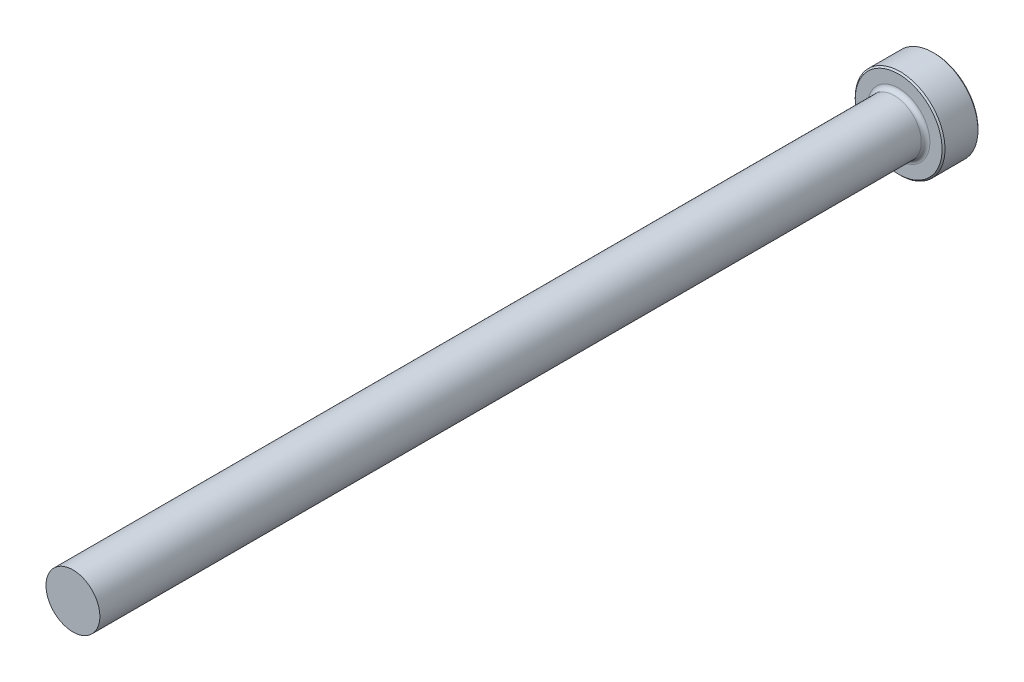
from build123d import *

# Parameters (mm, degrees)
CHAMFER1_SIZE = 0.254


with BuildPart() as part:
    # Sketch2 → Revolve1 (revolve)
    with BuildSketch(Plane(origin=(0, 0, 0), x_dir=(0, 0, 1), z_dir=(1, 0, 0)), mode=Mode.PRIVATE) as revolve1_sk:
        with BuildLine():
            Line((152.4, 0), (0, 0))
            Line((0, 0), (0, 7.9375))
            Line((0, 7.9375), (6.35, 7.9375))
            Line((6.35, 7.9375), (6.35, 5.5245))
            ThreePointArc((6.35, 5.5245), (6.573184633, 4.985684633), (7.112, 4.7625))
            Line((7.112, 4.7625), (152.4, 4.7625))
            Line((152.4, 4.7625), (152.4, 0))
        make_face()
    revolve(revolve1_sk.sketch.rotate(Axis((0, 0, -2.147539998), (0, 0, 1)), 270), axis=Axis((0, 0, -2.147539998), (0, 0, 1)))

    # Chamfer1
    chamfer1_edges = [part.edges().sort_by_distance(p)[0] for p in [
        (7.9375, 0, 6.35),
        (7.9375, 0, 0),
    ]]
    chamfer(chamfer1_edges, length=CHAMFER1_SIZE)


solid = part.part
